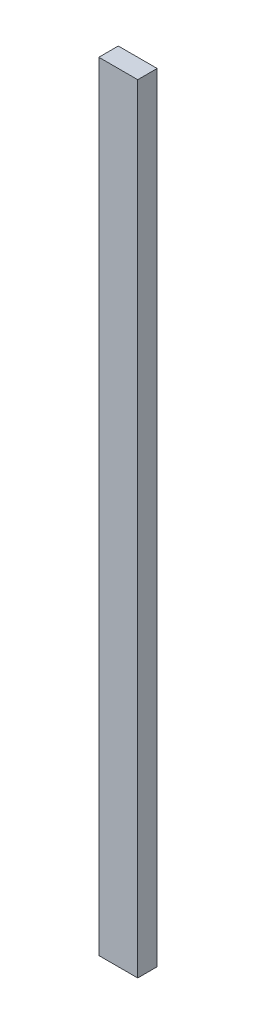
ISO-10303-21;
HEADER;
FILE_DESCRIPTION(('STEP AP214'),'2;1');
FILE_NAME('part.step','',(''),(''),'','','');
FILE_SCHEMA(('AUTOMOTIVE_DESIGN { 1 0 10303 214 1 1 1 1 }'));
ENDSEC;
DATA;
#1=APPLICATION_CONTEXT('core data for automotive mechanical design processes');
#2=APPLICATION_PROTOCOL_DEFINITION('international standard','automotive_design',2000,#1);
#3=PRODUCT_CONTEXT('',#1,'mechanical');
#4=PRODUCT('Part','Part','',(#3));
#5=PRODUCT_RELATED_PRODUCT_CATEGORY('part','',(#4));
#6=PRODUCT_DEFINITION_FORMATION('','',#4);
#7=PRODUCT_DEFINITION_CONTEXT('part definition',#1,'design');
#8=PRODUCT_DEFINITION('design','',#6,#7);
#9=PRODUCT_DEFINITION_SHAPE('','',#8);
#10=(LENGTH_UNIT() NAMED_UNIT(*) SI_UNIT(.MILLI.,.METRE.));
#11=(NAMED_UNIT(*) PLANE_ANGLE_UNIT() SI_UNIT($,.RADIAN.));
#12=(NAMED_UNIT(*) SI_UNIT($,.STERADIAN.) SOLID_ANGLE_UNIT());
#13=UNCERTAINTY_MEASURE_WITH_UNIT(LENGTH_MEASURE(1.E-05),#10,'distance_accuracy_value','');
#14=(GEOMETRIC_REPRESENTATION_CONTEXT(3) GLOBAL_UNCERTAINTY_ASSIGNED_CONTEXT((#13)) GLOBAL_UNIT_ASSIGNED_CONTEXT((#10,
#11,#12)) REPRESENTATION_CONTEXT('',''));
#15=CARTESIAN_POINT('',(0.,0.,0.));
#16=DIRECTION('',(0.,0.,1.));
#17=DIRECTION('',(1.,0.,0.));
#18=AXIS2_PLACEMENT_3D('',#15,#16,#17);
#19=CARTESIAN_POINT('',(-39.4239949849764,32.5007568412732,3.175));
#20=DIRECTION('',(1.,0.,0.));
#21=DIRECTION('',(0.,1.,0.));
#22=AXIS2_PLACEMENT_3D('',#19,#20,#21);
#23=PLANE('',#22);
#24=DIRECTION('',(0.,-1.,0.));
#25=VECTOR('',#24,1.);
#26=CARTESIAN_POINT('',(-39.4239949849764,32.5007568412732,0.));
#27=LINE('',#26,#25);
#28=CARTESIAN_POINT('',(-39.4239949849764,32.5007568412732,0.));
#29=VERTEX_POINT('',#28);
#30=CARTESIAN_POINT('',(-39.4239949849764,-94.4992431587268,0.));
#31=VERTEX_POINT('',#30);
#32=EDGE_CURVE('E96',#29,#31,#27,.T.);
#33=ORIENTED_EDGE('',*,*,#32,.T.);
#34=DIRECTION('',(0.,0.,-1.));
#35=VECTOR('',#34,1.);
#36=CARTESIAN_POINT('',(-39.4239949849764,-94.4992431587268,3.175));
#37=LINE('',#36,#35);
#38=CARTESIAN_POINT('',(-39.4239949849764,-94.4992431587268,3.175));
#39=VERTEX_POINT('',#38);
#40=EDGE_CURVE('E11',#39,#31,#37,.T.);
#41=ORIENTED_EDGE('',*,*,#40,.F.);
#42=DIRECTION('',(0.,-1.,0.));
#43=VECTOR('',#42,1.);
#44=CARTESIAN_POINT('',(-39.4239949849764,32.5007568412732,3.175));
#45=LINE('',#44,#43);
#46=CARTESIAN_POINT('',(-39.4239949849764,32.5007568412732,3.175));
#47=VERTEX_POINT('',#46);
#48=EDGE_CURVE('E84',#47,#39,#45,.T.);
#49=ORIENTED_EDGE('',*,*,#48,.F.);
#50=DIRECTION('',(0.,0.,-1.));
#51=VECTOR('',#50,1.);
#52=CARTESIAN_POINT('',(-39.4239949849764,32.5007568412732,3.175));
#53=LINE('',#52,#51);
#54=EDGE_CURVE('E92',#47,#29,#53,.T.);
#55=ORIENTED_EDGE('',*,*,#54,.T.);
#56=EDGE_LOOP('',(#33,#41,#49,#55));
#57=FACE_BOUND('',#56,.T.);
#58=ADVANCED_FACE('F33',(#57),#23,.F.);
#59=CARTESIAN_POINT('',(-39.4239949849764,-94.4992431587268,3.175));
#60=DIRECTION('',(0.,1.,0.));
#61=DIRECTION('',(0.,0.,1.));
#62=AXIS2_PLACEMENT_3D('',#59,#60,#61);
#63=PLANE('',#62);
#64=DIRECTION('',(1.,0.,0.));
#65=VECTOR('',#64,1.);
#66=CARTESIAN_POINT('',(-39.4239949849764,-94.4992431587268,0.));
#67=LINE('',#66,#65);
#68=CARTESIAN_POINT('',(-33.0739949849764,-94.4992431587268,0.));
#69=VERTEX_POINT('',#68);
#70=EDGE_CURVE('E88',#31,#69,#67,.T.);
#71=ORIENTED_EDGE('',*,*,#70,.T.);
#72=DIRECTION('',(0.,0.,-1.));
#73=VECTOR('',#72,1.);
#74=CARTESIAN_POINT('',(-33.0739949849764,-94.4992431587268,3.175));
#75=LINE('',#74,#73);
#76=CARTESIAN_POINT('',(-33.0739949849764,-94.4992431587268,3.175));
#77=VERTEX_POINT('',#76);
#78=EDGE_CURVE('E41',#77,#69,#75,.T.);
#79=ORIENTED_EDGE('',*,*,#78,.F.);
#80=DIRECTION('',(1.,0.,0.));
#81=VECTOR('',#80,1.);
#82=CARTESIAN_POINT('',(-39.4239949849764,-94.4992431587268,3.175));
#83=LINE('',#82,#81);
#84=EDGE_CURVE('E79',#39,#77,#83,.T.);
#85=ORIENTED_EDGE('',*,*,#84,.F.);
#86=ORIENTED_EDGE('',*,*,#40,.T.);
#87=EDGE_LOOP('',(#71,#79,#85,#86));
#88=FACE_BOUND('',#87,.T.);
#89=ADVANCED_FACE('F87',(#88),#63,.F.);
#90=CARTESIAN_POINT('',(-33.0739949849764,32.5007568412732,3.175));
#91=DIRECTION('',(-1.,0.,0.));
#92=DIRECTION('',(0.,-1.,0.));
#93=AXIS2_PLACEMENT_3D('',#90,#91,#92);
#94=PLANE('',#93);
#95=DIRECTION('',(0.,1.,0.));
#96=VECTOR('',#95,1.);
#97=CARTESIAN_POINT('',(-33.0739949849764,32.5007568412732,0.));
#98=LINE('',#97,#96);
#99=CARTESIAN_POINT('',(-33.0739949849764,32.5007568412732,0.));
#100=VERTEX_POINT('',#99);
#101=EDGE_CURVE('E66',#69,#100,#98,.T.);
#102=ORIENTED_EDGE('',*,*,#101,.T.);
#103=DIRECTION('',(0.,0.,-1.));
#104=VECTOR('',#103,1.);
#105=CARTESIAN_POINT('',(-33.0739949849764,32.5007568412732,3.175));
#106=LINE('',#105,#104);
#107=CARTESIAN_POINT('',(-33.0739949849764,32.5007568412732,3.175));
#108=VERTEX_POINT('',#107);
#109=EDGE_CURVE('E89',#108,#100,#106,.T.);
#110=ORIENTED_EDGE('',*,*,#109,.F.);
#111=DIRECTION('',(0.,1.,0.));
#112=VECTOR('',#111,1.);
#113=CARTESIAN_POINT('',(-33.0739949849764,32.5007568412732,3.175));
#114=LINE('',#113,#112);
#115=EDGE_CURVE('E82',#77,#108,#114,.T.);
#116=ORIENTED_EDGE('',*,*,#115,.F.);
#117=ORIENTED_EDGE('',*,*,#78,.T.);
#118=EDGE_LOOP('',(#102,#110,#116,#117));
#119=FACE_BOUND('',#118,.T.);
#120=ADVANCED_FACE('F90',(#119),#94,.F.);
#121=CARTESIAN_POINT('',(-39.4239949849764,32.5007568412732,3.175));
#122=DIRECTION('',(0.,-1.,0.));
#123=DIRECTION('',(0.,0.,-1.));
#124=AXIS2_PLACEMENT_3D('',#121,#122,#123);
#125=PLANE('',#124);
#126=DIRECTION('',(-1.,0.,0.));
#127=VECTOR('',#126,1.);
#128=CARTESIAN_POINT('',(-39.4239949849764,32.5007568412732,0.));
#129=LINE('',#128,#127);
#130=EDGE_CURVE('E72',#100,#29,#129,.T.);
#131=ORIENTED_EDGE('',*,*,#130,.T.);
#132=ORIENTED_EDGE('',*,*,#54,.F.);
#133=DIRECTION('',(-1.,0.,0.));
#134=VECTOR('',#133,1.);
#135=CARTESIAN_POINT('',(-39.4239949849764,32.5007568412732,3.175));
#136=LINE('',#135,#134);
#137=EDGE_CURVE('E49',#108,#47,#136,.T.);
#138=ORIENTED_EDGE('',*,*,#137,.F.);
#139=ORIENTED_EDGE('',*,*,#109,.T.);
#140=EDGE_LOOP('',(#131,#132,#138,#139));
#141=FACE_BOUND('',#140,.T.);
#142=ADVANCED_FACE('F103',(#141),#125,.F.);
#143=CARTESIAN_POINT('',(-39.4239949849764,-94.4992431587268,3.175));
#144=DIRECTION('',(0.,0.,1.));
#145=DIRECTION('',(1.,0.,0.));
#146=AXIS2_PLACEMENT_3D('',#143,#144,#145);
#147=PLANE('',#146);
#148=ORIENTED_EDGE('',*,*,#48,.T.);
#149=ORIENTED_EDGE('',*,*,#84,.T.);
#150=ORIENTED_EDGE('',*,*,#115,.T.);
#151=ORIENTED_EDGE('',*,*,#137,.T.);
#152=EDGE_LOOP('',(#148,#149,#150,#151));
#153=FACE_BOUND('',#152,.T.);
#154=ADVANCED_FACE('F80',(#153),#147,.T.);
#155=CARTESIAN_POINT('',(-39.4239949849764,-94.4992431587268,0.));
#156=DIRECTION('',(0.,0.,1.));
#157=DIRECTION('',(1.,0.,0.));
#158=AXIS2_PLACEMENT_3D('',#155,#156,#157);
#159=PLANE('',#158);
#160=ORIENTED_EDGE('',*,*,#32,.F.);
#161=ORIENTED_EDGE('',*,*,#130,.F.);
#162=ORIENTED_EDGE('',*,*,#101,.F.);
#163=ORIENTED_EDGE('',*,*,#70,.F.);
#164=EDGE_LOOP('',(#160,#161,#162,#163));
#165=FACE_BOUND('',#164,.T.);
#166=ADVANCED_FACE('F106',(#165),#159,.F.);
#167=CLOSED_SHELL('',(#58,#89,#120,#142,#154,#166));
#168=MANIFOLD_SOLID_BREP('B2',#167);
#169=ADVANCED_BREP_SHAPE_REPRESENTATION('',(#18,#168),#14);
#170=SHAPE_DEFINITION_REPRESENTATION(#9,#169);
ENDSEC;
END-ISO-10303-21;
